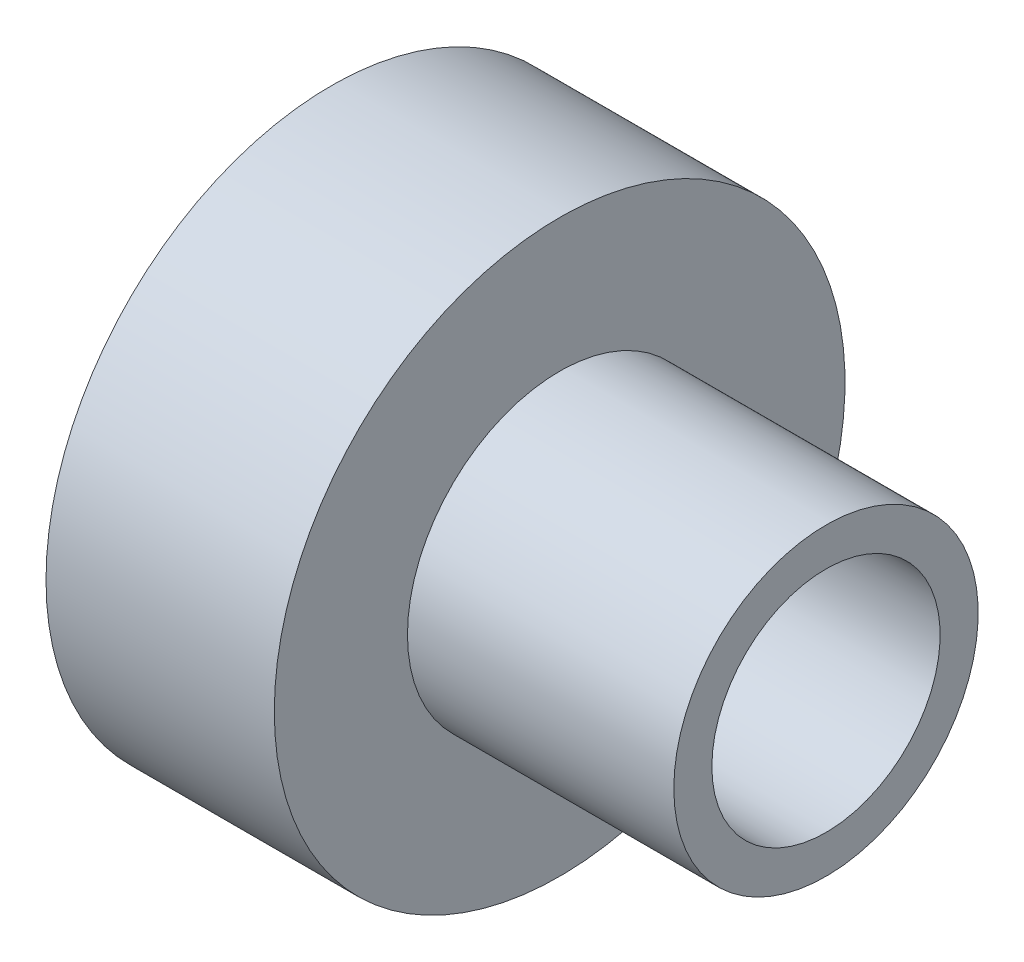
from build123d import *


with BuildPart() as part:
    # Sketch1 → Revolve1 (revolve)
    with BuildSketch(Plane.XY, mode=Mode.PRIVATE) as revolve1_sk:
        Polygon((8.710698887, 3), (21.710698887, 3), (21.710698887, 4), (14.710698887, 4), (14.710698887, 7.5), (8.710698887, 7.5), align=None)
    revolve(revolve1_sk.sketch.rotate(Axis((0, 0, 0), (1, 0, 0)), 90), axis=Axis((0, 0, 0), (1, 0, 0)))


solid = part.part
